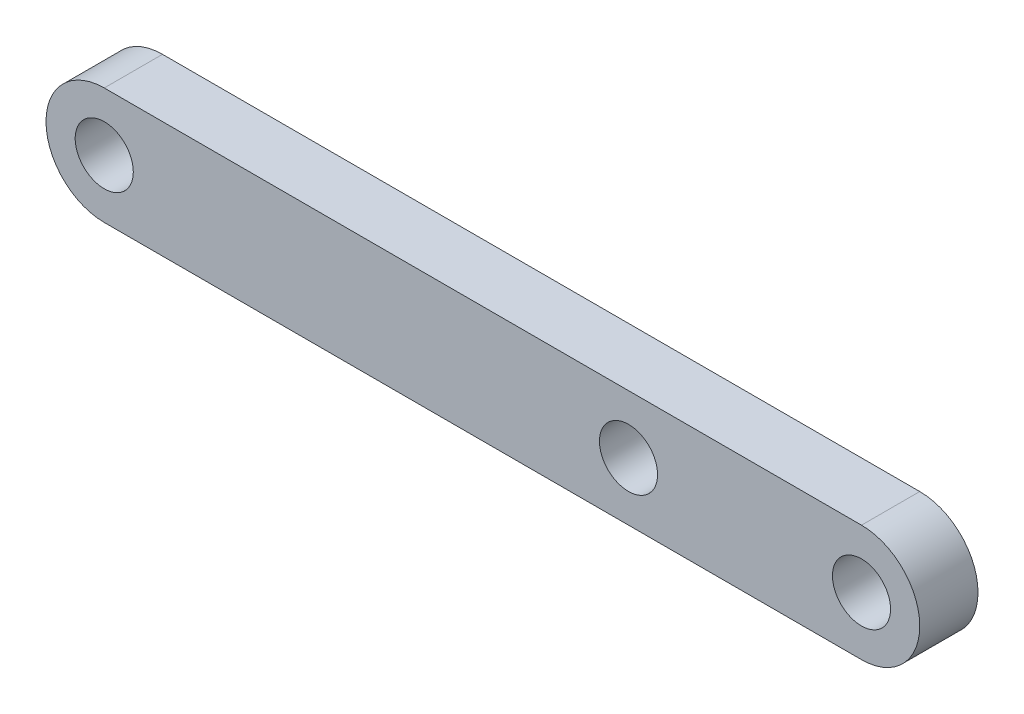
from build123d import *

# Parameters (mm, degrees)
SKETCH2_R           = 1.584200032
SKETCH2_R_2         = 1.58420004
BOSS_EXTRUDE1_DEPTH = 3.175


with BuildPart() as part:
    # Sketch2 → Boss-Extrude1 (new body)
    with BuildSketch(Plane.XY):
        with BuildLine():
            Line((-20.6375, 3.175), (20.6375, 3.175))
            ThreePointArc((20.6375, 3.175), (23.8125, 0), (20.6375, -3.175))
            Line((20.6375, -3.175), (-20.6375, -3.175))
            ThreePointArc((-20.6375, -3.175), (-23.8125, 0), (-20.6375, 3.175))
        make_face()
        with Locations((-20.6375, 0)):
            Circle(SKETCH2_R, mode=Mode.SUBTRACT)
        with Locations((7.9375, 0)):
            Circle(SKETCH2_R, mode=Mode.SUBTRACT)
        with Locations((20.6375, 0)):
            Circle(SKETCH2_R_2, mode=Mode.SUBTRACT)
    extrude(amount=-BOSS_EXTRUDE1_DEPTH)


solid = part.part
